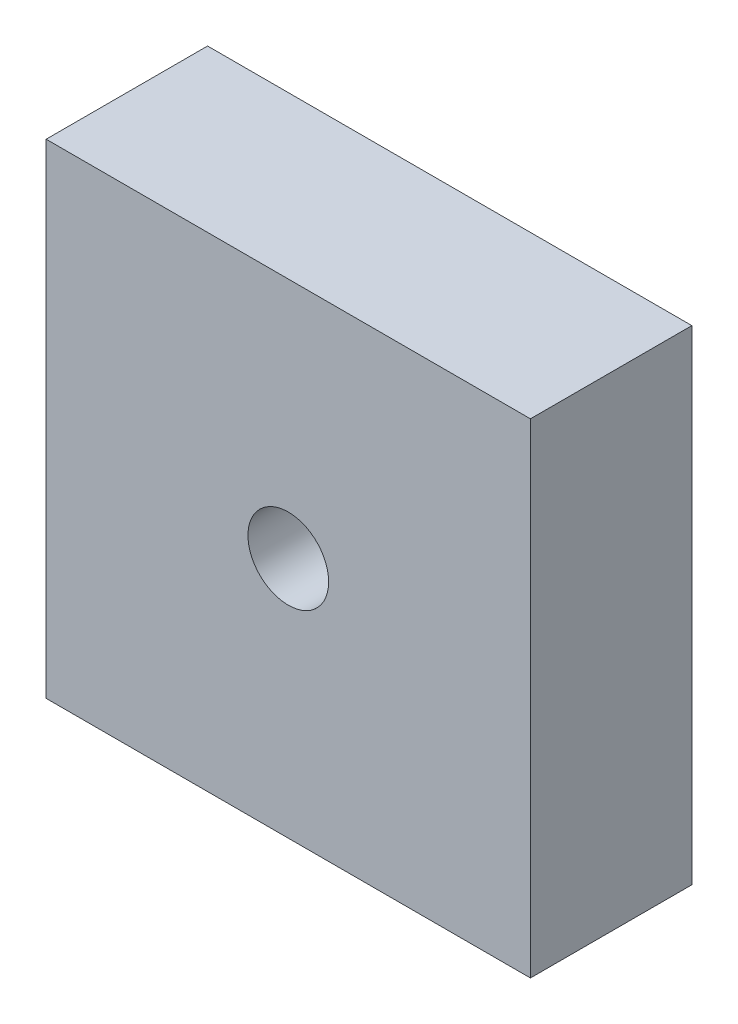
from build123d import *

# Parameters (mm, degrees)
CROQUIS1_W              = 30
CROQUIS1_H              = 30
CROQUIS1_R              = 2.5
SALIENTE_EXTRUIR1_DEPTH = 5


with BuildPart() as part:
    # Croquis1 → Saliente-Extruir1 (new, symmetric)
    with BuildSketch(Plane.XY):
        Rectangle(CROQUIS1_W, CROQUIS1_H)
        Circle(CROQUIS1_R, mode=Mode.SUBTRACT)
    extrude(amount=SALIENTE_EXTRUIR1_DEPTH, both=True)


solid = part.part
